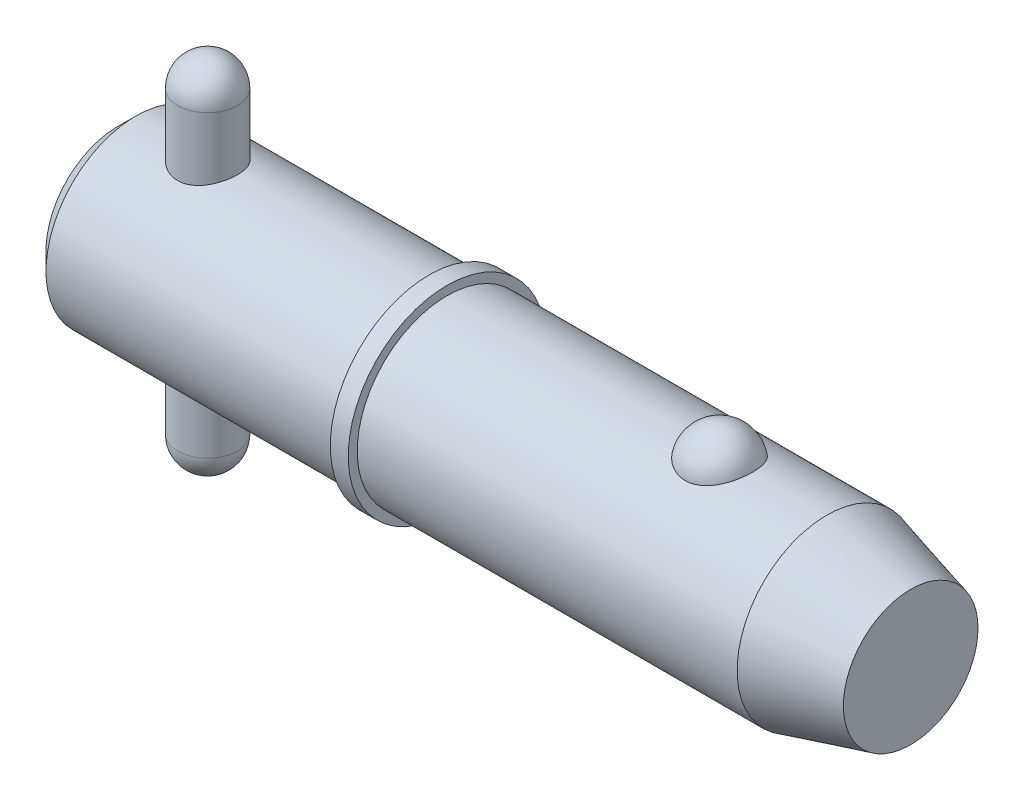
ISO-10303-21;
HEADER;
FILE_DESCRIPTION(('STEP AP214'),'2;1');
FILE_NAME('part.step','',(''),(''),'','','');
FILE_SCHEMA(('AUTOMOTIVE_DESIGN { 1 0 10303 214 1 1 1 1 }'));
ENDSEC;
DATA;
#1=APPLICATION_CONTEXT('core data for automotive mechanical design processes');
#2=APPLICATION_PROTOCOL_DEFINITION('international standard','automotive_design',2000,#1);
#3=PRODUCT_CONTEXT('',#1,'mechanical');
#4=PRODUCT('Part','Part','',(#3));
#5=PRODUCT_RELATED_PRODUCT_CATEGORY('part','',(#4));
#6=PRODUCT_DEFINITION_FORMATION('','',#4);
#7=PRODUCT_DEFINITION_CONTEXT('part definition',#1,'design');
#8=PRODUCT_DEFINITION('design','',#6,#7);
#9=PRODUCT_DEFINITION_SHAPE('','',#8);
#10=(LENGTH_UNIT() NAMED_UNIT(*) SI_UNIT(.MILLI.,.METRE.));
#11=(NAMED_UNIT(*) PLANE_ANGLE_UNIT() SI_UNIT($,.RADIAN.));
#12=(NAMED_UNIT(*) SI_UNIT($,.STERADIAN.) SOLID_ANGLE_UNIT());
#13=UNCERTAINTY_MEASURE_WITH_UNIT(LENGTH_MEASURE(1.E-05),#10,'distance_accuracy_value','');
#14=(GEOMETRIC_REPRESENTATION_CONTEXT(3) GLOBAL_UNCERTAINTY_ASSIGNED_CONTEXT((#13)) GLOBAL_UNIT_ASSIGNED_CONTEXT((#10,
#11,#12)) REPRESENTATION_CONTEXT('',''));
#15=CARTESIAN_POINT('',(0.,0.,0.));
#16=DIRECTION('',(0.,0.,1.));
#17=DIRECTION('',(1.,0.,0.));
#18=AXIS2_PLACEMENT_3D('',#15,#16,#17);
#19=CARTESIAN_POINT('',(9.525,19.05,0.));
#20=DIRECTION('',(0.,-1.,0.));
#21=DIRECTION('',(0.,0.,-1.));
#22=AXIS2_PLACEMENT_3D('',#19,#20,#21);
#23=CYLINDRICAL_SURFACE('',#22,3.175);
#24=CARTESIAN_POINT('',(9.525,-15.875,0.));
#25=DIRECTION('',(0.,-1.,0.));
#26=DIRECTION('',(0.,0.,-1.));
#27=AXIS2_PLACEMENT_3D('',#24,#25,#26);
#28=CIRCLE('',#27,3.175);
#29=CARTESIAN_POINT('',(9.525,-15.875,-3.175));
#30=VERTEX_POINT('',#29);
#31=EDGE_CURVE('P0_E10',#30,#30,#28,.F.);
#32=CARTESIAN_POINT('',(9.525,15.875,0.));
#33=DIRECTION('',(0.,-1.,0.));
#34=DIRECTION('',(0.,0.,-1.));
#35=AXIS2_PLACEMENT_3D('',#32,#33,#34);
#36=CIRCLE('',#35,3.175);
#37=CARTESIAN_POINT('',(9.525,15.875,-3.175));
#38=VERTEX_POINT('',#37);
#39=EDGE_CURVE('P0_E21',#38,#38,#36,.T.);
#40=CARTESIAN_POINT('',(9.525,-15.875,-3.175));
#41=CARTESIAN_POINT('',(9.525,-15.5442708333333,-3.175));
#42=CARTESIAN_POINT('',(9.525,-15.2135416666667,-3.175));
#43=CARTESIAN_POINT('',(9.525,-14.5520833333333,-3.175));
#44=CARTESIAN_POINT('',(9.525,-14.2213541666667,-3.175));
#45=CARTESIAN_POINT('',(9.525,-13.5598958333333,-3.175));
#46=CARTESIAN_POINT('',(9.525,-13.2291666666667,-3.175));
#47=CARTESIAN_POINT('',(9.525,-12.5677083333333,-3.175));
#48=CARTESIAN_POINT('',(9.525,-12.2369791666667,-3.175));
#49=CARTESIAN_POINT('',(9.525,-11.5755208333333,-3.175));
#50=CARTESIAN_POINT('',(9.525,-11.2447916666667,-3.175));
#51=CARTESIAN_POINT('',(9.525,-10.5833333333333,-3.175));
#52=CARTESIAN_POINT('',(9.525,-10.2526041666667,-3.175));
#53=CARTESIAN_POINT('',(9.525,-9.59114583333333,-3.175));
#54=CARTESIAN_POINT('',(9.525,-9.26041666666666,-3.175));
#55=CARTESIAN_POINT('',(9.525,-8.59895833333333,-3.175));
#56=CARTESIAN_POINT('',(9.525,-8.26822916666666,-3.175));
#57=CARTESIAN_POINT('',(9.525,-7.60677083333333,-3.175));
#58=CARTESIAN_POINT('',(9.525,-7.27604166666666,-3.175));
#59=CARTESIAN_POINT('',(9.525,-6.61458333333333,-3.175));
#60=CARTESIAN_POINT('',(9.525,-6.28385416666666,-3.175));
#61=CARTESIAN_POINT('',(9.525,-5.62239583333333,-3.175));
#62=CARTESIAN_POINT('',(9.525,-5.29166666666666,-3.175));
#63=CARTESIAN_POINT('',(9.525,-4.63020833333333,-3.175));
#64=CARTESIAN_POINT('',(9.525,-4.29947916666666,-3.175));
#65=CARTESIAN_POINT('',(9.525,-3.63802083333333,-3.175));
#66=CARTESIAN_POINT('',(9.525,-3.30729166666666,-3.175));
#67=CARTESIAN_POINT('',(9.525,-2.64583333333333,-3.175));
#68=CARTESIAN_POINT('',(9.525,-2.31510416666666,-3.175));
#69=CARTESIAN_POINT('',(9.525,-1.65364583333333,-3.175));
#70=CARTESIAN_POINT('',(9.525,-1.32291666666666,-3.175));
#71=CARTESIAN_POINT('',(9.525,-0.661458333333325,-3.175));
#72=CARTESIAN_POINT('',(9.525,-0.330729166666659,-3.175));
#73=CARTESIAN_POINT('',(9.525,0.330729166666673,-3.175));
#74=CARTESIAN_POINT('',(9.525,0.661458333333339,-3.175));
#75=CARTESIAN_POINT('',(9.525,1.32291666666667,-3.175));
#76=CARTESIAN_POINT('',(9.525,1.65364583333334,-3.175));
#77=CARTESIAN_POINT('',(9.525,2.31510416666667,-3.175));
#78=CARTESIAN_POINT('',(9.525,2.64583333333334,-3.175));
#79=CARTESIAN_POINT('',(9.525,3.30729166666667,-3.175));
#80=CARTESIAN_POINT('',(9.525,3.63802083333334,-3.175));
#81=CARTESIAN_POINT('',(9.525,4.29947916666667,-3.175));
#82=CARTESIAN_POINT('',(9.525,4.63020833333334,-3.175));
#83=CARTESIAN_POINT('',(9.525,5.29166666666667,-3.175));
#84=CARTESIAN_POINT('',(9.525,5.62239583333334,-3.175));
#85=CARTESIAN_POINT('',(9.525,6.28385416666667,-3.175));
#86=CARTESIAN_POINT('',(9.525,6.61458333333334,-3.175));
#87=CARTESIAN_POINT('',(9.525,7.27604166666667,-3.175));
#88=CARTESIAN_POINT('',(9.525,7.60677083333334,-3.175));
#89=CARTESIAN_POINT('',(9.525,8.26822916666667,-3.175));
#90=CARTESIAN_POINT('',(9.525,8.59895833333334,-3.175));
#91=CARTESIAN_POINT('',(9.525,9.26041666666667,-3.175));
#92=CARTESIAN_POINT('',(9.525,9.59114583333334,-3.175));
#93=CARTESIAN_POINT('',(9.525,10.2526041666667,-3.175));
#94=CARTESIAN_POINT('',(9.525,10.5833333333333,-3.175));
#95=CARTESIAN_POINT('',(9.525,11.2447916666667,-3.175));
#96=CARTESIAN_POINT('',(9.525,11.5755208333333,-3.175));
#97=CARTESIAN_POINT('',(9.525,12.2369791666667,-3.175));
#98=CARTESIAN_POINT('',(9.525,12.5677083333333,-3.175));
#99=CARTESIAN_POINT('',(9.525,13.2291666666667,-3.175));
#100=CARTESIAN_POINT('',(9.525,13.5598958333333,-3.175));
#101=CARTESIAN_POINT('',(9.525,14.2213541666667,-3.175));
#102=CARTESIAN_POINT('',(9.525,14.5520833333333,-3.175));
#103=CARTESIAN_POINT('',(9.525,15.2135416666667,-3.175));
#104=CARTESIAN_POINT('',(9.525,15.5442708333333,-3.175));
#105=CARTESIAN_POINT('',(9.525,15.875,-3.175));
#106=B_SPLINE_CURVE_WITH_KNOTS('',3,(#40,#41,#42,#43,#44,#45,#46,#47,#48,#49,#50,#51,#52,#53,
#54,#55,#56,#57,#58,#59,#60,#61,#62,#63,#64,#65,#66,#67,#68,#69,#70,#71,#72,#73,#74,#75,#76,#77,
#78,#79,#80,#81,#82,#83,#84,#85,#86,#87,#88,#89,#90,#91,#92,#93,#94,#95,#96,#97,#98,#99,#100,
#101,#102,#103,#104,#105),.UNSPECIFIED.,.F.,.F.,(4,2,2,2,2,2,2,2,2,2,2,2,2,2,2,2,2,2,2,2,2,2,2,
2,2,2,2,2,2,2,2,2,4),(0.,0.992187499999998,1.984375,2.9765625,3.96875,4.96093749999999,5.953125,
6.9453125,7.9375,8.92968749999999,9.921875,10.9140625,11.90625,12.8984375,13.890625,14.8828125,
15.875,16.8671875,17.859375,18.8515625,19.84375,20.8359375,21.828125,22.8203125,23.8125,
24.8046875,25.796875,26.7890625,27.78125,28.7734375,29.765625,30.7578125,31.75),.UNSPECIFIED.);
#107=EDGE_CURVE('P0_BSEAM14',#30,#38,#106,.T.);
#108=ORIENTED_EDGE('',*,*,#31,.T.);
#109=ORIENTED_EDGE('',*,*,#39,.T.);
#110=ORIENTED_EDGE('',*,*,#107,.T.);
#111=ORIENTED_EDGE('',*,*,#107,.F.);
#112=EDGE_LOOP('',(#108,#110,#109,#111));
#113=FACE_BOUND('',#112,.T.);
#114=ADVANCED_FACE('P0_F14',(#113),#23,.T.);
#115=CARTESIAN_POINT('',(9.525,-15.875,0.));
#116=DIRECTION('',(0.,0.,1.));
#117=DIRECTION('',(1.,0.,0.));
#118=AXIS2_PLACEMENT_3D('',#115,#116,#117);
#119=SPHERICAL_SURFACE('',#118,3.175);
#120=CARTESIAN_POINT('',(9.525,-15.875,0.));
#121=DIRECTION('',(0.,-1.,0.));
#122=DIRECTION('',(0.,0.,-1.));
#123=AXIS2_PLACEMENT_3D('',#120,#121,#122);
#124=SPHERICAL_SURFACE('',#123,3.175);
#125=ORIENTED_EDGE('',*,*,#31,.F.);
#126=EDGE_LOOP('',(#125));
#127=FACE_BOUND('',#126,.T.);
#128=ADVANCED_FACE('P0_F29',(#127),#124,.T.);
#129=CARTESIAN_POINT('',(9.525,15.875,0.));
#130=DIRECTION('',(0.,0.,1.));
#131=DIRECTION('',(1.,0.,0.));
#132=AXIS2_PLACEMENT_3D('',#129,#130,#131);
#133=SPHERICAL_SURFACE('',#132,3.175);
#134=CARTESIAN_POINT('',(9.525,15.875,0.));
#135=DIRECTION('',(0.,-1.,0.));
#136=DIRECTION('',(0.,0.,-1.));
#137=AXIS2_PLACEMENT_3D('',#134,#135,#136);
#138=SPHERICAL_SURFACE('',#137,3.175);
#139=ORIENTED_EDGE('',*,*,#39,.F.);
#140=EDGE_LOOP('',(#139));
#141=FACE_BOUND('',#140,.T.);
#142=ADVANCED_FACE('P0_F16',(#141),#138,.T.);
#143=CLOSED_SHELL('',(#114,#128,#142));
#144=MANIFOLD_SOLID_BREP('P0_B1',#143);
#145=CARTESIAN_POINT('',(0.,0.,0.));
#146=DIRECTION('',(1.,0.,0.));
#147=DIRECTION('',(0.,0.,-1.));
#148=AXIS2_PLACEMENT_3D('',#145,#146,#147);
#149=CYLINDRICAL_SURFACE('',#148,9.525);
#150=CARTESIAN_POINT('',(75.2430540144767,0.,0.));
#151=DIRECTION('',(1.,0.,0.));
#152=DIRECTION('',(0.,0.,-1.));
#153=AXIS2_PLACEMENT_3D('',#150,#151,#152);
#154=CIRCLE('',#153,9.525);
#155=CARTESIAN_POINT('',(75.2430540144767,0.,-9.525));
#156=VERTEX_POINT('',#155);
#157=EDGE_CURVE('P1_E81',#156,#156,#154,.T.);
#158=ORIENTED_EDGE('',*,*,#157,.F.);
#159=EDGE_LOOP('',(#158));
#160=FACE_BOUND('',#159,.T.);
#161=CARTESIAN_POINT('',(34.93,0.,0.));
#162=DIRECTION('',(1.,0.,0.));
#163=DIRECTION('',(0.,0.,-1.));
#164=AXIS2_PLACEMENT_3D('',#161,#162,#163);
#165=CIRCLE('',#164,9.525);
#166=CARTESIAN_POINT('',(34.93,0.,-9.525));
#167=VERTEX_POINT('',#166);
#168=EDGE_CURVE('P1_E85',#167,#167,#165,.T.);
#169=ORIENTED_EDGE('',*,*,#168,.T.);
#170=EDGE_LOOP('',(#169));
#171=FACE_BOUND('',#170,.T.);
#172=CARTESIAN_POINT('',(63.8457573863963,8.80405803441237,3.63513233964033));
#173=CARTESIAN_POINT('',(63.7516766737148,8.80405953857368,3.6351305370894));
#174=CARTESIAN_POINT('',(63.6575618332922,8.80561325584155,3.63137461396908));
#175=CARTESIAN_POINT('',(63.4700126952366,8.8117774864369,3.61638665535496));
#176=CARTESIAN_POINT('',(63.3765788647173,8.81638992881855,3.60514990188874));
#177=CARTESIAN_POINT('',(63.0979452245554,8.83467114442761,3.56024627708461));
#178=CARTESIAN_POINT('',(62.9146916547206,8.85278327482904,3.51538626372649));
#179=CARTESIAN_POINT('',(62.5595099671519,8.89871214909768,3.39742145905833));
#180=CARTESIAN_POINT('',(62.3875533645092,8.92650327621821,3.32439116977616));
#181=CARTESIAN_POINT('',(62.0587075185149,8.9887481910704,3.15220244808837));
#182=CARTESIAN_POINT('',(61.9018114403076,9.02319893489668,3.05305594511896));
#183=CARTESIAN_POINT('',(61.6022147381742,9.09629186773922,2.82797815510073));
#184=CARTESIAN_POINT('',(61.4600600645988,9.13502685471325,2.70135138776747));
#185=CARTESIAN_POINT('',(61.1982999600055,9.2118657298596,2.42641932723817));
#186=CARTESIAN_POINT('',(61.0787015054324,9.24996941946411,2.27810735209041));
#187=CARTESIAN_POINT('',(60.859645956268,9.32341082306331,1.95652290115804));
#188=CARTESIAN_POINT('',(60.7613174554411,9.35855090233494,1.78243511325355));
#189=CARTESIAN_POINT('',(60.5938190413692,9.42045142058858,1.419372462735));
#190=CARTESIAN_POINT('',(60.5246511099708,9.44721128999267,1.23039658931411));
#191=CARTESIAN_POINT('',(60.4161994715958,9.48990641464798,0.840370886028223));
#192=CARTESIAN_POINT('',(60.3772880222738,9.50570658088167,0.639202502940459));
#193=CARTESIAN_POINT('',(60.3315550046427,9.52433146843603,0.232664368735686));
#194=CARTESIAN_POINT('',(60.3247324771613,9.52715657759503,0.0272947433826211));
#195=CARTESIAN_POINT('',(60.343255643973,9.51956918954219,-0.380478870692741));
#196=CARTESIAN_POINT('',(60.3684052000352,9.50923740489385,-0.582893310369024));
#197=CARTESIAN_POINT('',(60.4500253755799,9.47651897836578,-0.980293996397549));
#198=CARTESIAN_POINT('',(60.5064966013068,9.45413210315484,-1.17528009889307));
#199=CARTESIAN_POINT('',(60.6497192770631,9.39954044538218,-1.55263697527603));
#200=CARTESIAN_POINT('',(60.7365124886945,9.36732213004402,-1.73498993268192));
#201=CARTESIAN_POINT('',(60.9386103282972,9.29640700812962,-2.08177763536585));
#202=CARTESIAN_POINT('',(61.0539172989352,9.25770966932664,-2.24621090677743));
#203=CARTESIAN_POINT('',(61.311264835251,9.17775604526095,-2.55338333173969));
#204=CARTESIAN_POINT('',(61.4534344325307,9.136488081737,-2.69601150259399));
#205=CARTESIAN_POINT('',(61.76089985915,9.05620497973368,-2.95451229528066));
#206=CARTESIAN_POINT('',(61.9261937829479,9.01718965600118,-3.070387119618));
#207=CARTESIAN_POINT('',(62.272052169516,8.94680019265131,-3.26976836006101));
#208=CARTESIAN_POINT('',(62.4522278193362,8.91528408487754,-3.35389750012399));
#209=CARTESIAN_POINT('',(62.8256514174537,8.86272514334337,-3.49043503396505));
#210=CARTESIAN_POINT('',(63.0188944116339,8.84167836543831,-3.54285537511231));
#211=CARTESIAN_POINT('',(63.4025036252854,8.81348056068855,-3.61241306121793));
#212=CARTESIAN_POINT('',(63.5925251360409,8.80568348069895,-3.63119339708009));
#213=CARTESIAN_POINT('',(63.9731906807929,8.80289410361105,-3.63795342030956));
#214=CARTESIAN_POINT('',(64.1638345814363,8.80789922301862,-3.62593932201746));
#215=CARTESIAN_POINT('',(64.534007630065,8.82974915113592,-3.57238430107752));
#216=CARTESIAN_POINT('',(64.7136976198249,8.84621463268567,-3.53178890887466));
#217=CARTESIAN_POINT('',(65.063422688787,8.88875330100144,-3.42331083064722));
#218=CARTESIAN_POINT('',(65.2334569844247,8.91482726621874,-3.35542593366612));
#219=CARTESIAN_POINT('',(65.5632377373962,8.97448239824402,-3.19248225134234));
#220=CARTESIAN_POINT('',(65.7226801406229,9.0082144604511,-3.09686474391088));
#221=CARTESIAN_POINT('',(66.0235136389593,9.07935398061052,-2.88162736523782));
#222=CARTESIAN_POINT('',(66.1649005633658,9.11676228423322,-2.76200196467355));
#223=CARTESIAN_POINT('',(66.4333193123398,9.19347419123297,-2.49516285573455));
#224=CARTESIAN_POINT('',(66.5592750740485,9.23277872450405,-2.34686614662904));
#225=CARTESIAN_POINT('',(66.7855227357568,9.3073761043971,-2.03093683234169));
#226=CARTESIAN_POINT('',(66.8858100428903,9.34266823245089,-1.86330077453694));
#227=CARTESIAN_POINT('',(67.0615149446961,9.40674710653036,-1.50744893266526));
#228=CARTESIAN_POINT('',(67.136041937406,9.43529176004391,-1.31874876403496));
#229=CARTESIAN_POINT('',(67.2541650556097,9.48144132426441,-0.930631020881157));
#230=CARTESIAN_POINT('',(67.2977608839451,9.49904612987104,-0.731213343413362));
#231=CARTESIAN_POINT('',(67.3531580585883,9.5215314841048,-0.327147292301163));
#232=CARTESIAN_POINT('',(67.3649354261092,9.52640243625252,-0.122495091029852));
#233=CARTESIAN_POINT('',(67.3563825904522,9.5228957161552,0.28601848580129));
#234=CARTESIAN_POINT('',(67.3360530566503,9.5145183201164,0.489879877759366));
#235=CARTESIAN_POINT('',(67.2638840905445,9.48544083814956,0.889994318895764));
#236=CARTESIAN_POINT('',(67.2121993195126,9.46480124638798,1.08627971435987));
#237=CARTESIAN_POINT('',(67.0784917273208,9.41333895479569,1.46682086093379));
#238=CARTESIAN_POINT('',(66.9964668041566,9.38251554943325,1.65107577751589));
#239=CARTESIAN_POINT('',(66.8031929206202,9.31365636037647,2.00346348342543));
#240=CARTESIAN_POINT('',(66.6917838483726,9.27558138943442,2.17150083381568));
#241=CARTESIAN_POINT('',(66.4422947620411,9.19638714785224,2.48563115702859));
#242=CARTESIAN_POINT('',(66.3042163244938,9.15526805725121,2.63172542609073));
#243=CARTESIAN_POINT('',(66.0048438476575,9.07465393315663,2.89750997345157));
#244=CARTESIAN_POINT('',(65.8436109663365,9.03515496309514,3.01726776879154));
#245=CARTESIAN_POINT('',(65.5016136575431,8.96227564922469,3.22732920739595));
#246=CARTESIAN_POINT('',(65.3208418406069,8.92889763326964,3.31762165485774));
#247=CARTESIAN_POINT('',(64.9514451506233,8.8734538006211,3.46314419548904));
#248=CARTESIAN_POINT('',(64.7633237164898,8.85102983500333,3.51950082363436));
#249=CARTESIAN_POINT('',(64.4757869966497,8.8266696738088,3.57993683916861));
#250=CARTESIAN_POINT('',(64.3791339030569,8.82009725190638,3.59606217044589));
#251=CARTESIAN_POINT('',(64.1846770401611,8.81020897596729,3.62022512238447));
#252=CARTESIAN_POINT('',(64.0868741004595,8.80689090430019,3.62826825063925));
#253=CARTESIAN_POINT('',(63.9412243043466,8.80445615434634,3.6341676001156));
#254=CARTESIAN_POINT('',(63.8934952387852,8.80405727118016,3.63513325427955));
#255=CARTESIAN_POINT('',(63.8457573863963,8.80405803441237,3.63513233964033));
#256=B_SPLINE_CURVE_WITH_KNOTS('',3,(#172,#173,#174,#175,#176,#177,#178,#179,#180,#181,#182,
#183,#184,#185,#186,#187,#188,#189,#190,#191,#192,#193,#194,#195,#196,#197,#198,#199,#200,#201,
#202,#203,#204,#205,#206,#207,#208,#209,#210,#211,#212,#213,#214,#215,#216,#217,#218,#219,#220,
#221,#222,#223,#224,#225,#226,#227,#228,#229,#230,#231,#232,#233,#234,#235,#236,#237,#238,#239,
#240,#241,#242,#243,#244,#245,#246,#247,#248,#249,#250,#251,#252,#253,#254,#255),.UNSPECIFIED.,
.T.,.F.,(4,2,2,2,2,2,2,2,2,2,2,2,2,2,2,2,2,2,2,2,2,2,2,2,2,2,2,2,2,2,2,2,2,2,2,2,2,2,2,2,2,4),
(0.,0.282202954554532,0.564584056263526,1.13017050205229,1.69427128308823,2.25811483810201,
2.83836627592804,3.4187968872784,4.0249711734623,4.63118665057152,5.24474754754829,
5.85829010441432,6.46808687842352,7.07789545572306,7.68854723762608,8.29924920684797,
8.91296283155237,9.5266259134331,10.1275338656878,10.7282152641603,11.2986646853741,
11.8689989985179,12.4213015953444,12.973648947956,13.5380053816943,14.1024919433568,
14.6952986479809,15.2882113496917,15.8999469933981,16.5116885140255,17.1238909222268,
17.7360805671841,18.3452748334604,18.9545113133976,19.5671386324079,20.179729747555,
20.7907316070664,21.4019653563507,21.9915938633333,22.2859053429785,22.5800161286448,
22.7232098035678),.UNSPECIFIED.);
#257=CARTESIAN_POINT('',(63.8457573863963,8.80405803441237,3.63513233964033));
#258=VERTEX_POINT('',#257);
#259=EDGE_CURVE('P1_E35',#258,#258,#256,.T.);
#260=ORIENTED_EDGE('',*,*,#259,.T.);
#261=EDGE_LOOP('',(#260));
#262=FACE_BOUND('',#261,.T.);
#263=ADVANCED_FACE('P1_F13',(#160,#171,#262),#149,.T.);
#264=CARTESIAN_POINT('',(0.,0.,0.));
#265=DIRECTION('',(-1.,0.,0.));
#266=DIRECTION('',(0.,0.,1.));
#267=AXIS2_PLACEMENT_3D('',#264,#265,#266);
#268=PLANE('',#267);
#269=CARTESIAN_POINT('',(0.,0.,0.));
#270=DIRECTION('',(1.,0.,0.));
#271=DIRECTION('',(0.,0.,-1.));
#272=AXIS2_PLACEMENT_3D('',#269,#270,#271);
#273=CIRCLE('',#272,7.62);
#274=CARTESIAN_POINT('',(0.,0.,-7.62));
#275=VERTEX_POINT('',#274);
#276=EDGE_CURVE('P1_E9',#275,#275,#273,.T.);
#277=ORIENTED_EDGE('',*,*,#276,.F.);
#278=EDGE_LOOP('',(#277));
#279=FACE_BOUND('',#278,.T.);
#280=ADVANCED_FACE('P1_F15',(#279),#268,.T.);
#281=CARTESIAN_POINT('',(1.90499999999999,0.,0.));
#282=DIRECTION('',(1.,0.,0.));
#283=DIRECTION('',(0.,0.,-1.));
#284=AXIS2_PLACEMENT_3D('',#281,#282,#283);
#285=CONICAL_SURFACE('',#284,9.525,0.785398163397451);
#286=ORIENTED_EDGE('',*,*,#276,.T.);
#287=EDGE_LOOP('',(#286));
#288=FACE_BOUND('',#287,.T.);
#289=CARTESIAN_POINT('',(1.90499999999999,0.,0.));
#290=DIRECTION('',(1.,0.,0.));
#291=DIRECTION('',(0.,0.,-1.));
#292=AXIS2_PLACEMENT_3D('',#289,#290,#291);
#293=CIRCLE('',#292,9.525);
#294=CARTESIAN_POINT('',(1.90499999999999,0.,-9.525));
#295=VERTEX_POINT('',#294);
#296=EDGE_CURVE('P1_E26',#295,#295,#293,.T.);
#297=ORIENTED_EDGE('',*,*,#296,.F.);
#298=EDGE_LOOP('',(#297));
#299=FACE_BOUND('',#298,.T.);
#300=ADVANCED_FACE('P1_F77',(#288,#299),#285,.T.);
#301=CARTESIAN_POINT('',(0.,0.,0.));
#302=DIRECTION('',(1.,0.,0.));
#303=DIRECTION('',(0.,0.,-1.));
#304=AXIS2_PLACEMENT_3D('',#301,#302,#303);
#305=CYLINDRICAL_SURFACE('',#304,9.525);
#306=CARTESIAN_POINT('',(9.525,-8.98025612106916,3.175));
#307=CARTESIAN_POINT('',(9.35206354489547,-8.98025555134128,3.17500081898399));
#308=CARTESIAN_POINT('',(9.17913201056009,-8.98530617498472,3.16082293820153));
#309=CARTESIAN_POINT('',(8.83839221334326,-9.00485797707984,3.10467734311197));
#310=CARTESIAN_POINT('',(8.67058479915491,-9.0193607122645,3.06270505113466));
#311=CARTESIAN_POINT('',(8.34508461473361,-9.05599546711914,2.95260866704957));
#312=CARTESIAN_POINT('',(8.18737272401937,-9.07811252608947,2.88453582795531));
#313=CARTESIAN_POINT('',(7.88555684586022,-9.12746212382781,2.72434567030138));
#314=CARTESIAN_POINT('',(7.74145587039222,-9.1546957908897,2.63222304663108));
#315=CARTESIAN_POINT('',(7.46531411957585,-9.21240503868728,2.42268738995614));
#316=CARTESIAN_POINT('',(7.33388351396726,-9.24296141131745,2.30449228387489));
#317=CARTESIAN_POINT('',(7.09229340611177,-9.30319020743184,2.0478358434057));
#318=CARTESIAN_POINT('',(6.98213731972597,-9.33286248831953,1.90937126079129));
#319=CARTESIAN_POINT('',(6.78345450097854,-9.38891527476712,1.61164431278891));
#320=CARTESIAN_POINT('',(6.69556709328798,-9.41518969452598,1.45193356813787));
#321=CARTESIAN_POINT('',(6.54814671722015,-9.46053437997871,1.11896913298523));
#322=CARTESIAN_POINT('',(6.48860610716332,-9.47960658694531,0.945719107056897));
#323=CARTESIAN_POINT('',(6.40163866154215,-9.50782564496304,0.596991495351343));
#324=CARTESIAN_POINT('',(6.373166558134,-9.5172947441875,0.421801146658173));
#325=CARTESIAN_POINT('',(6.3458207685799,-9.52638456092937,0.068890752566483));
#326=CARTESIAN_POINT('',(6.34693945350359,-9.52600781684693,-0.108828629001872));
#327=CARTESIAN_POINT('',(6.37808050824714,-9.51566675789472,-0.454353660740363));
#328=CARTESIAN_POINT('',(6.4069675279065,-9.50607905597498,-0.622274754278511));
#329=CARTESIAN_POINT('',(6.490947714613,-9.47886621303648,-0.950732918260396));
#330=CARTESIAN_POINT('',(6.54604265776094,-9.46124052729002,-1.11126948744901));
#331=CARTESIAN_POINT('',(6.68153768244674,-9.41945253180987,-1.42288410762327));
#332=CARTESIAN_POINT('',(6.76226085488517,-9.3952073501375,-1.57381010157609));
#333=CARTESIAN_POINT('',(6.94645456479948,-9.34270397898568,-1.86030973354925));
#334=CARTESIAN_POINT('',(7.04993142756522,-9.31444467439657,-1.99587908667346));
#335=CARTESIAN_POINT('',(7.28241619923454,-9.25532159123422,-2.2545702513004));
#336=CARTESIAN_POINT('',(7.4123967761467,-9.22439783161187,-2.37680549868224));
#337=CARTESIAN_POINT('',(7.69127470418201,-9.1645528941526,-2.5980302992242));
#338=CARTESIAN_POINT('',(7.84017496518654,-9.13563202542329,-2.6970162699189));
#339=CARTESIAN_POINT('',(8.15547526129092,-9.08273917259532,-2.87016016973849));
#340=CARTESIAN_POINT('',(8.32209451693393,-9.05884361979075,-2.94394402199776));
#341=CARTESIAN_POINT('',(8.66638917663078,-9.01959241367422,-3.06210713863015));
#342=CARTESIAN_POINT('',(8.84405991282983,-9.00423318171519,-3.10649872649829));
#343=CARTESIAN_POINT('',(9.19682677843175,-8.98460345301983,-3.16281207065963));
#344=CARTESIAN_POINT('',(9.37167742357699,-8.9798639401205,-3.17610837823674));
#345=CARTESIAN_POINT('',(9.72113927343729,-8.9806993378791,-3.17374726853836));
#346=CARTESIAN_POINT('',(9.89575051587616,-8.98627237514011,-3.15809511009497));
#347=CARTESIAN_POINT('',(10.2335233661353,-9.00663737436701,-3.09951644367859));
#348=CARTESIAN_POINT('',(10.3968722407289,-9.02110608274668,-3.05754530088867));
#349=CARTESIAN_POINT('',(10.7141759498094,-9.05727657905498,-2.94866651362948));
#350=CARTESIAN_POINT('',(10.8681291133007,-9.07897964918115,-2.88175444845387));
#351=CARTESIAN_POINT('',(11.1676828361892,-9.12802586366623,-2.72248103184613));
#352=CARTESIAN_POINT('',(11.3128635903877,-9.1555260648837,-2.62937980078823));
#353=CARTESIAN_POINT('',(11.5860387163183,-9.21276315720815,-2.42120937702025));
#354=CARTESIAN_POINT('',(11.7140280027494,-9.24250070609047,-2.30613370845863));
#355=CARTESIAN_POINT('',(11.9555513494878,-9.30259247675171,-2.05070616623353));
#356=CARTESIAN_POINT('',(12.0680936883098,-9.33290753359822,-1.90940458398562));
#357=CARTESIAN_POINT('',(12.267933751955,-9.3893275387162,-1.60917665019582));
#358=CARTESIAN_POINT('',(12.3552323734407,-9.41543263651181,-1.45025092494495));
#359=CARTESIAN_POINT('',(12.5013088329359,-9.46036988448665,-1.12007606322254));
#360=CARTESIAN_POINT('',(12.5602723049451,-9.47924920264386,-0.9489158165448));
#361=CARTESIAN_POINT('',(12.6483355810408,-9.50781089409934,-0.598355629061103));
#362=CARTESIAN_POINT('',(12.6774461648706,-9.5174965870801,-0.4189586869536));
#363=CARTESIAN_POINT('',(12.7040070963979,-9.52632915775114,-0.066088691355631));
#364=CARTESIAN_POINT('',(12.7028811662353,-9.52594996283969,0.107266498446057));
#365=CARTESIAN_POINT('',(12.6725130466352,-9.51586223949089,0.451202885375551));
#366=CARTESIAN_POINT('',(12.643273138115,-9.50615446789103,0.621784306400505));
#367=CARTESIAN_POINT('',(12.5584514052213,-9.47867404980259,0.952633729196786));
#368=CARTESIAN_POINT('',(12.5032953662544,-9.46103195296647,1.1130225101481));
#369=CARTESIAN_POINT('',(12.3686013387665,-9.41949985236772,1.42233126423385));
#370=CARTESIAN_POINT('',(12.2890589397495,-9.39560871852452,1.57124915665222));
#371=CARTESIAN_POINT('',(12.1044667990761,-9.34294133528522,1.85938800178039));
#372=CARTESIAN_POINT('',(11.9985831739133,-9.31401720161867,1.9980473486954));
#373=CARTESIAN_POINT('',(11.7657327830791,-9.25490239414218,2.25609475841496));
#374=CARTESIAN_POINT('',(11.6387592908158,-9.22471131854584,2.37547664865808));
#375=CARTESIAN_POINT('',(11.3613902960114,-9.16505913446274,2.59633024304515));
#376=CARTESIAN_POINT('',(11.2102725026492,-9.13567286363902,2.69691791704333));
#377=CARTESIAN_POINT('',(10.8923631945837,-9.08241113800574,2.87119803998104));
#378=CARTESIAN_POINT('',(10.7255757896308,-9.05853424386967,2.94489751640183));
#379=CARTESIAN_POINT('',(10.3887212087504,-9.02021736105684,3.06020415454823));
#380=CARTESIAN_POINT('',(10.219143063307,-9.00539959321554,3.10311136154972));
#381=CARTESIAN_POINT('',(9.87470703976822,-8.98542092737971,3.16050396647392));
#382=CARTESIAN_POINT('',(9.699851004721,-8.98025669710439,3.17499917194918));
#383=CARTESIAN_POINT('',(9.525,-8.98025612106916,3.175));
#384=B_SPLINE_CURVE_WITH_KNOTS('',3,(#306,#307,#308,#309,#310,#311,#312,#313,#314,#315,#316,
#317,#318,#319,#320,#321,#322,#323,#324,#325,#326,#327,#328,#329,#330,#331,#332,#333,#334,#335,
#336,#337,#338,#339,#340,#341,#342,#343,#344,#345,#346,#347,#348,#349,#350,#351,#352,#353,#354,
#355,#356,#357,#358,#359,#360,#361,#362,#363,#364,#365,#366,#367,#368,#369,#370,#371,#372,#373,
#374,#375,#376,#377,#378,#379,#380,#381,#382,#383),.UNSPECIFIED.,.T.,.F.,(4,2,2,2,2,2,2,2,2,2,2,
2,2,2,2,2,2,2,2,2,2,2,2,2,2,2,2,2,2,2,2,2,2,2,2,2,2,2,4),(0.,0.518161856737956,1.03640907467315,
1.55364379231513,2.07099270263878,2.60671746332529,3.14252816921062,3.69231882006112,
4.24196117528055,4.77247962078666,5.30286129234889,5.81244090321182,6.32205505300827,
6.83836754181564,7.3548237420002,7.89559553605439,8.43645060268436,8.98501631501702,
9.53335188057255,10.056948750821,10.5804505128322,11.0859695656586,11.5915782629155,
12.1132237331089,12.6350231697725,13.1819271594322,13.7288117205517,14.2720628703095,
14.815117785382,15.3326491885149,15.8501386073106,16.3594083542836,16.868770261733,
17.3969527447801,17.925304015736,18.4743376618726,19.023227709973,19.5473069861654,
20.0712053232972),.UNSPECIFIED.);
#385=CARTESIAN_POINT('',(9.525,-8.98025612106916,3.175));
#386=VERTEX_POINT('',#385);
#387=EDGE_CURVE('P1_E17',#386,#386,#384,.T.);
#388=ORIENTED_EDGE('',*,*,#387,.F.);
#389=EDGE_LOOP('',(#388));
#390=FACE_BOUND('',#389,.T.);
#391=CARTESIAN_POINT('',(9.525,8.98025612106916,3.175));
#392=CARTESIAN_POINT('',(9.69793645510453,8.98025555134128,3.17500081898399));
#393=CARTESIAN_POINT('',(9.87086798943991,8.98530617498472,3.16082293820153));
#394=CARTESIAN_POINT('',(10.2116077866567,9.00485797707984,3.10467734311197));
#395=CARTESIAN_POINT('',(10.3794152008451,9.0193607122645,3.06270505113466));
#396=CARTESIAN_POINT('',(10.7049153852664,9.05599546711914,2.95260866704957));
#397=CARTESIAN_POINT('',(10.8626272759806,9.07811252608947,2.88453582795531));
#398=CARTESIAN_POINT('',(11.1644431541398,9.12746212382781,2.72434567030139));
#399=CARTESIAN_POINT('',(11.3085441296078,9.15469579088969,2.63222304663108));
#400=CARTESIAN_POINT('',(11.5846858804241,9.21240503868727,2.42268738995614));
#401=CARTESIAN_POINT('',(11.7161164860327,9.24296141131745,2.30449228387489));
#402=CARTESIAN_POINT('',(11.9577065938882,9.30319020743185,2.0478358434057));
#403=CARTESIAN_POINT('',(12.067862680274,9.33286248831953,1.90937126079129));
#404=CARTESIAN_POINT('',(12.2665454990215,9.38891527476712,1.61164431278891));
#405=CARTESIAN_POINT('',(12.354432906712,9.41518969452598,1.45193356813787));
#406=CARTESIAN_POINT('',(12.5018532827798,9.46053437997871,1.11896913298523));
#407=CARTESIAN_POINT('',(12.5613938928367,9.47960658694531,0.945719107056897));
#408=CARTESIAN_POINT('',(12.6483613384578,9.50782564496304,0.596991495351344));
#409=CARTESIAN_POINT('',(12.676833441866,9.5172947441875,0.421801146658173));
#410=CARTESIAN_POINT('',(12.7041792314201,9.52638456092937,0.0688907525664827));
#411=CARTESIAN_POINT('',(12.7030605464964,9.52600781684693,-0.108828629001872));
#412=CARTESIAN_POINT('',(12.6719194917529,9.51566675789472,-0.454353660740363));
#413=CARTESIAN_POINT('',(12.6430324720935,9.50607905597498,-0.622274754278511));
#414=CARTESIAN_POINT('',(12.559052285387,9.47886621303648,-0.950732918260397));
#415=CARTESIAN_POINT('',(12.5039573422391,9.46124052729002,-1.11126948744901));
#416=CARTESIAN_POINT('',(12.3684623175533,9.41945253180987,-1.42288410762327));
#417=CARTESIAN_POINT('',(12.2877391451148,9.3952073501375,-1.57381010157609));
#418=CARTESIAN_POINT('',(12.1035454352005,9.34270397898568,-1.86030973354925));
#419=CARTESIAN_POINT('',(12.0000685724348,9.31444467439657,-1.99587908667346));
#420=CARTESIAN_POINT('',(11.7675838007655,9.25532159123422,-2.2545702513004));
#421=CARTESIAN_POINT('',(11.6376032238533,9.22439783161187,-2.37680549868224));
#422=CARTESIAN_POINT('',(11.358725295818,9.1645528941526,-2.5980302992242));
#423=CARTESIAN_POINT('',(11.2098250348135,9.13563202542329,-2.6970162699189));
#424=CARTESIAN_POINT('',(10.8945247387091,9.08273917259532,-2.87016016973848));
#425=CARTESIAN_POINT('',(10.7279054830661,9.05884361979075,-2.94394402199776));
#426=CARTESIAN_POINT('',(10.3836108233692,9.01959241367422,-3.06210713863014));
#427=CARTESIAN_POINT('',(10.2059400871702,9.00423318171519,-3.10649872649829));
#428=CARTESIAN_POINT('',(9.85317322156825,8.98460345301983,-3.16281207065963));
#429=CARTESIAN_POINT('',(9.67832257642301,8.9798639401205,-3.17610837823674));
#430=CARTESIAN_POINT('',(9.32886072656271,8.9806993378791,-3.17374726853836));
#431=CARTESIAN_POINT('',(9.15424948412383,8.98627237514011,-3.15809511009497));
#432=CARTESIAN_POINT('',(8.81647663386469,9.00663737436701,-3.09951644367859));
#433=CARTESIAN_POINT('',(8.65312775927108,9.02110608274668,-3.05754530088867));
#434=CARTESIAN_POINT('',(8.33582405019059,9.05727657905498,-2.94866651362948));
#435=CARTESIAN_POINT('',(8.18187088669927,9.07897964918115,-2.88175444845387));
#436=CARTESIAN_POINT('',(7.88231716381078,9.12802586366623,-2.72248103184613));
#437=CARTESIAN_POINT('',(7.73713640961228,9.1555260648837,-2.62937980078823));
#438=CARTESIAN_POINT('',(7.46396128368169,9.21276315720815,-2.42120937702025));
#439=CARTESIAN_POINT('',(7.33597199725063,9.24250070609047,-2.30613370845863));
#440=CARTESIAN_POINT('',(7.09444865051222,9.30259247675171,-2.05070616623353));
#441=CARTESIAN_POINT('',(6.98190631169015,9.33290753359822,-1.90940458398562));
#442=CARTESIAN_POINT('',(6.78206624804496,9.3893275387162,-1.60917665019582));
#443=CARTESIAN_POINT('',(6.6947676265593,9.41543263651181,-1.45025092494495));
#444=CARTESIAN_POINT('',(6.54869116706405,9.46036988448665,-1.12007606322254));
#445=CARTESIAN_POINT('',(6.48972769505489,9.47924920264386,-0.948915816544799));
#446=CARTESIAN_POINT('',(6.40166441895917,9.50781089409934,-0.598355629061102));
#447=CARTESIAN_POINT('',(6.3725538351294,9.5174965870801,-0.418958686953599));
#448=CARTESIAN_POINT('',(6.34599290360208,9.52632915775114,-0.0660886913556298));
#449=CARTESIAN_POINT('',(6.3471188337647,9.52594996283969,0.107266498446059));
#450=CARTESIAN_POINT('',(6.37748695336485,9.51586223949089,0.451202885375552));
#451=CARTESIAN_POINT('',(6.40672686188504,9.50615446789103,0.621784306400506));
#452=CARTESIAN_POINT('',(6.49154859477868,9.47867404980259,0.952633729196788));
#453=CARTESIAN_POINT('',(6.54670463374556,9.46103195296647,1.11302251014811));
#454=CARTESIAN_POINT('',(6.68139866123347,9.41949985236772,1.42233126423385));
#455=CARTESIAN_POINT('',(6.76094106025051,9.39560871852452,1.57124915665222));
#456=CARTESIAN_POINT('',(6.94553320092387,9.34294133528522,1.85938800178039));
#457=CARTESIAN_POINT('',(7.05141682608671,9.31401720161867,1.9980473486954));
#458=CARTESIAN_POINT('',(7.28426721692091,9.25490239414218,2.25609475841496));
#459=CARTESIAN_POINT('',(7.41124070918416,9.22471131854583,2.37547664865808));
#460=CARTESIAN_POINT('',(7.68860970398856,9.16505913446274,2.59633024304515));
#461=CARTESIAN_POINT('',(7.83972749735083,9.13567286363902,2.69691791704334));
#462=CARTESIAN_POINT('',(8.15763680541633,9.08241113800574,2.87119803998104));
#463=CARTESIAN_POINT('',(8.32442421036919,9.05853424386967,2.94489751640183));
#464=CARTESIAN_POINT('',(8.66127879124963,9.02021736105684,3.06020415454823));
#465=CARTESIAN_POINT('',(8.83085693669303,9.00539959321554,3.10311136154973));
#466=CARTESIAN_POINT('',(9.17529296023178,8.98542092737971,3.16050396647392));
#467=CARTESIAN_POINT('',(9.350148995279,8.98025669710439,3.17499917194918));
#468=CARTESIAN_POINT('',(9.525,8.98025612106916,3.175));
#469=B_SPLINE_CURVE_WITH_KNOTS('',3,(#391,#392,#393,#394,#395,#396,#397,#398,#399,#400,#401,
#402,#403,#404,#405,#406,#407,#408,#409,#410,#411,#412,#413,#414,#415,#416,#417,#418,#419,#420,
#421,#422,#423,#424,#425,#426,#427,#428,#429,#430,#431,#432,#433,#434,#435,#436,#437,#438,#439,
#440,#441,#442,#443,#444,#445,#446,#447,#448,#449,#450,#451,#452,#453,#454,#455,#456,#457,#458,
#459,#460,#461,#462,#463,#464,#465,#466,#467,#468),.UNSPECIFIED.,.T.,.F.,(4,2,2,2,2,2,2,2,2,2,2,
2,2,2,2,2,2,2,2,2,2,2,2,2,2,2,2,2,2,2,2,2,2,2,2,2,2,2,4),(0.,0.518161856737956,1.03640907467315,
1.55364379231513,2.07099270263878,2.60671746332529,3.14252816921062,3.69231882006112,
4.24196117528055,4.77247962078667,5.30286129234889,5.81244090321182,6.32205505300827,
6.83836754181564,7.3548237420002,7.89559553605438,8.43645060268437,8.98501631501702,
9.53335188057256,10.056948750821,10.5804505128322,11.0859695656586,11.5915782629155,
12.1132237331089,12.6350231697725,13.1819271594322,13.7288117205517,14.2720628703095,
14.815117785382,15.3326491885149,15.8501386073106,16.3594083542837,16.868770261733,
17.3969527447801,17.9253040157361,18.4743376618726,19.023227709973,19.5473069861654,
20.0712053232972),.UNSPECIFIED.);
#470=CARTESIAN_POINT('',(9.525,8.98025612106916,3.175));
#471=VERTEX_POINT('',#470);
#472=EDGE_CURVE('P1_E43',#471,#471,#469,.T.);
#473=ORIENTED_EDGE('',*,*,#472,.F.);
#474=EDGE_LOOP('',(#473));
#475=FACE_BOUND('',#474,.T.);
#476=ORIENTED_EDGE('',*,*,#296,.T.);
#477=EDGE_LOOP('',(#476));
#478=FACE_BOUND('',#477,.T.);
#479=CARTESIAN_POINT('',(33.025,0.,0.));
#480=DIRECTION('',(1.,0.,0.));
#481=DIRECTION('',(0.,0.,-1.));
#482=AXIS2_PLACEMENT_3D('',#479,#480,#481);
#483=CIRCLE('',#482,9.525);
#484=CARTESIAN_POINT('',(33.025,0.,-9.525));
#485=VERTEX_POINT('',#484);
#486=EDGE_CURVE('P1_E31',#485,#485,#483,.T.);
#487=ORIENTED_EDGE('',*,*,#486,.F.);
#488=EDGE_LOOP('',(#487));
#489=FACE_BOUND('',#488,.T.);
#490=ADVANCED_FACE('P1_F103',(#390,#475,#478,#489),#305,.T.);
#491=CARTESIAN_POINT('',(33.025,9.525,0.));
#492=DIRECTION('',(-1.,0.,0.));
#493=DIRECTION('',(0.,0.,1.));
#494=AXIS2_PLACEMENT_3D('',#491,#492,#493);
#495=PLANE('',#494);
#496=ORIENTED_EDGE('',*,*,#486,.T.);
#497=EDGE_LOOP('',(#496));
#498=FACE_BOUND('',#497,.T.);
#499=CARTESIAN_POINT('',(33.025,0.,0.));
#500=DIRECTION('',(1.,0.,0.));
#501=DIRECTION('',(0.,0.,-1.));
#502=AXIS2_PLACEMENT_3D('',#499,#500,#501);
#503=CIRCLE('',#502,10.4775);
#504=CARTESIAN_POINT('',(33.025,0.,-10.4775));
#505=VERTEX_POINT('',#504);
#506=EDGE_CURVE('P1_E91',#505,#505,#503,.T.);
#507=ORIENTED_EDGE('',*,*,#506,.F.);
#508=EDGE_LOOP('',(#507));
#509=FACE_BOUND('',#508,.T.);
#510=ADVANCED_FACE('P1_F100',(#498,#509),#495,.T.);
#511=CARTESIAN_POINT('',(0.,0.,0.));
#512=DIRECTION('',(1.,0.,0.));
#513=DIRECTION('',(0.,0.,-1.));
#514=AXIS2_PLACEMENT_3D('',#511,#512,#513);
#515=CYLINDRICAL_SURFACE('',#514,10.4775);
#516=ORIENTED_EDGE('',*,*,#506,.T.);
#517=EDGE_LOOP('',(#516));
#518=FACE_BOUND('',#517,.T.);
#519=CARTESIAN_POINT('',(34.93,0.,0.));
#520=DIRECTION('',(1.,0.,0.));
#521=DIRECTION('',(0.,0.,-1.));
#522=AXIS2_PLACEMENT_3D('',#519,#520,#521);
#523=CIRCLE('',#522,10.4775);
#524=CARTESIAN_POINT('',(34.93,0.,-10.4775));
#525=VERTEX_POINT('',#524);
#526=EDGE_CURVE('P1_E88',#525,#525,#523,.T.);
#527=ORIENTED_EDGE('',*,*,#526,.F.);
#528=EDGE_LOOP('',(#527));
#529=FACE_BOUND('',#528,.T.);
#530=ADVANCED_FACE('P1_F68',(#518,#529),#515,.T.);
#531=CARTESIAN_POINT('',(34.93,10.4775,0.));
#532=DIRECTION('',(1.,0.,0.));
#533=DIRECTION('',(0.,0.,-1.));
#534=AXIS2_PLACEMENT_3D('',#531,#532,#533);
#535=PLANE('',#534);
#536=ORIENTED_EDGE('',*,*,#526,.T.);
#537=EDGE_LOOP('',(#536));
#538=FACE_BOUND('',#537,.T.);
#539=ORIENTED_EDGE('',*,*,#168,.F.);
#540=EDGE_LOOP('',(#539));
#541=FACE_BOUND('',#540,.T.);
#542=ADVANCED_FACE('P1_F62',(#538,#541),#535,.T.);
#543=CARTESIAN_POINT('',(84.13,0.,0.));
#544=DIRECTION('',(-1.,0.,0.));
#545=DIRECTION('',(0.,0.,1.));
#546=AXIS2_PLACEMENT_3D('',#543,#544,#545);
#547=CONICAL_SURFACE('',#546,7.14375000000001,0.26179938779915);
#548=ORIENTED_EDGE('',*,*,#157,.T.);
#549=EDGE_LOOP('',(#548));
#550=FACE_BOUND('',#549,.T.);
#551=CARTESIAN_POINT('',(84.13,0.,0.));
#552=DIRECTION('',(1.,0.,0.));
#553=DIRECTION('',(0.,0.,-1.));
#554=AXIS2_PLACEMENT_3D('',#551,#552,#553);
#555=CIRCLE('',#554,7.14375000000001);
#556=CARTESIAN_POINT('',(84.13,0.,-7.14375000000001));
#557=VERTEX_POINT('',#556);
#558=EDGE_CURVE('P1_E42',#557,#557,#555,.T.);
#559=ORIENTED_EDGE('',*,*,#558,.F.);
#560=EDGE_LOOP('',(#559));
#561=FACE_BOUND('',#560,.T.);
#562=ADVANCED_FACE('P1_F59',(#550,#561),#547,.T.);
#563=CARTESIAN_POINT('',(84.13,7.14375000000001,0.));
#564=DIRECTION('',(1.,0.,0.));
#565=DIRECTION('',(0.,0.,-1.));
#566=AXIS2_PLACEMENT_3D('',#563,#564,#565);
#567=PLANE('',#566);
#568=ORIENTED_EDGE('',*,*,#558,.T.);
#569=EDGE_LOOP('',(#568));
#570=FACE_BOUND('',#569,.T.);
#571=ADVANCED_FACE('P1_F55',(#570),#567,.T.);
#572=CARTESIAN_POINT('',(63.8457573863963,8.5725,0.));
#573=DIRECTION('',(-1.,0.,0.));
#574=DIRECTION('',(0.,1.,0.));
#575=AXIS2_PLACEMENT_3D('',#572,#573,#574);
#576=SPHERICAL_SURFACE('',#575,3.64249999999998);
#577=ORIENTED_EDGE('',*,*,#259,.F.);
#578=EDGE_LOOP('',(#577));
#579=FACE_BOUND('',#578,.T.);
#580=ADVANCED_FACE('P1_F50',(#579),#576,.T.);
#581=CARTESIAN_POINT('',(9.525,-10.4775,0.));
#582=DIRECTION('',(0.,1.,0.));
#583=DIRECTION('',(0.,0.,1.));
#584=AXIS2_PLACEMENT_3D('',#581,#582,#583);
#585=CYLINDRICAL_SURFACE('',#584,3.175);
#586=ORIENTED_EDGE('',*,*,#387,.T.);
#587=EDGE_LOOP('',(#586));
#588=FACE_BOUND('',#587,.T.);
#589=ORIENTED_EDGE('',*,*,#472,.T.);
#590=EDGE_LOOP('',(#589));
#591=FACE_BOUND('',#590,.T.);
#592=ADVANCED_FACE('P1_F54',(#588,#591),#585,.F.);
#593=CLOSED_SHELL('',(#263,#280,#300,#490,#510,#530,#542,#562,#571,#580,#592));
#594=MANIFOLD_SOLID_BREP('P1_B1',#593);
#595=ADVANCED_BREP_SHAPE_REPRESENTATION('',(#18,#144,#594),#14);
#596=SHAPE_DEFINITION_REPRESENTATION(#9,#595);
ENDSEC;
END-ISO-10303-21;
